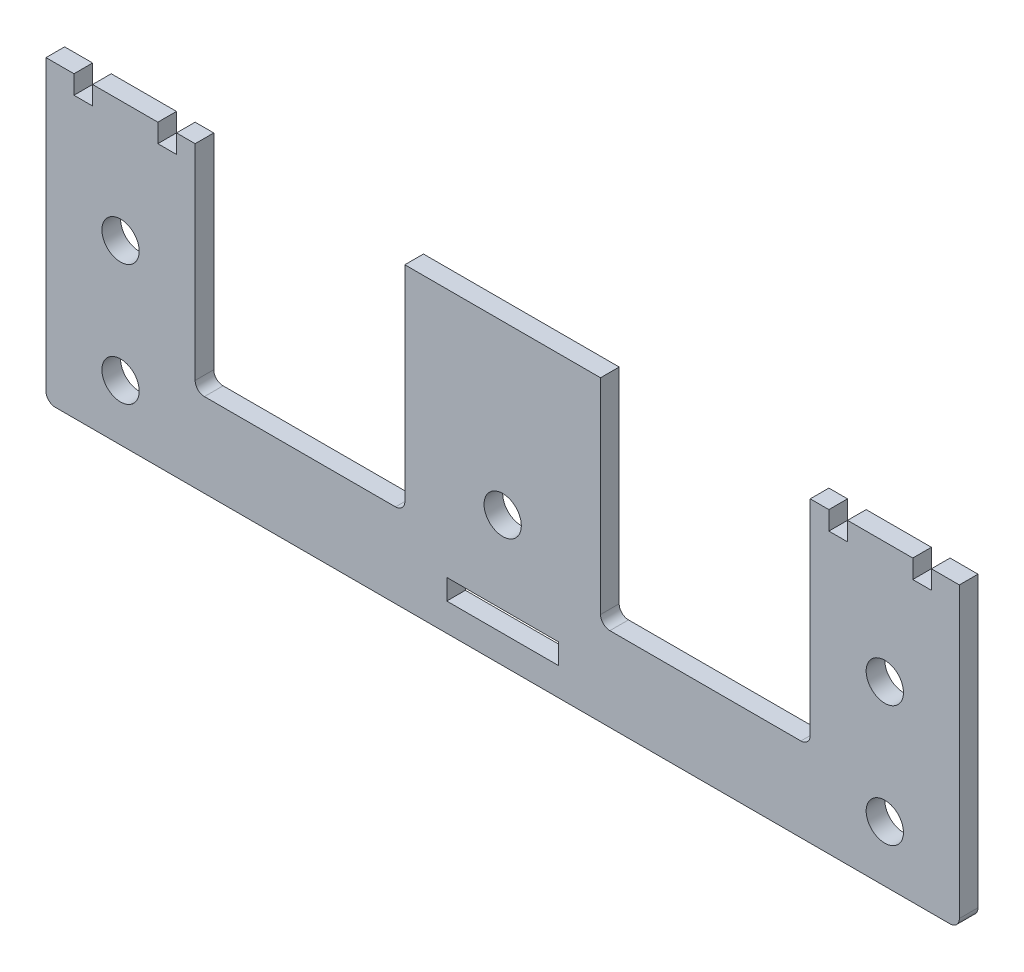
ISO-10303-21;
HEADER;
FILE_DESCRIPTION(('STEP AP214'),'2;1');
FILE_NAME('part.step','',(''),(''),'','','');
FILE_SCHEMA(('AUTOMOTIVE_DESIGN { 1 0 10303 214 1 1 1 1 }'));
ENDSEC;
DATA;
#1=APPLICATION_CONTEXT('core data for automotive mechanical design processes');
#2=APPLICATION_PROTOCOL_DEFINITION('international standard','automotive_design',2000,#1);
#3=PRODUCT_CONTEXT('',#1,'mechanical');
#4=PRODUCT('Part','Part','',(#3));
#5=PRODUCT_RELATED_PRODUCT_CATEGORY('part','',(#4));
#6=PRODUCT_DEFINITION_FORMATION('','',#4);
#7=PRODUCT_DEFINITION_CONTEXT('part definition',#1,'design');
#8=PRODUCT_DEFINITION('design','',#6,#7);
#9=PRODUCT_DEFINITION_SHAPE('','',#8);
#10=(LENGTH_UNIT() NAMED_UNIT(*) SI_UNIT(.MILLI.,.METRE.));
#11=(NAMED_UNIT(*) PLANE_ANGLE_UNIT() SI_UNIT($,.RADIAN.));
#12=(NAMED_UNIT(*) SI_UNIT($,.STERADIAN.) SOLID_ANGLE_UNIT());
#13=UNCERTAINTY_MEASURE_WITH_UNIT(LENGTH_MEASURE(1.E-05),#10,'distance_accuracy_value','');
#14=(GEOMETRIC_REPRESENTATION_CONTEXT(3) GLOBAL_UNCERTAINTY_ASSIGNED_CONTEXT((#13)) GLOBAL_UNIT_ASSIGNED_CONTEXT((#10,
#11,#12)) REPRESENTATION_CONTEXT('',''));
#15=CARTESIAN_POINT('',(0.,0.,0.));
#16=DIRECTION('',(0.,0.,1.));
#17=DIRECTION('',(1.,0.,0.));
#18=AXIS2_PLACEMENT_3D('',#15,#16,#17);
#19=CARTESIAN_POINT('',(24.,0.5,1.));
#20=DIRECTION('',(0.,0.,1.));
#21=DIRECTION('',(1.,0.,0.));
#22=AXIS2_PLACEMENT_3D('',#19,#20,#21);
#23=PLANE('',#22);
#24=CARTESIAN_POINT('',(-20.5,3.,1.));
#25=DIRECTION('',(0.,0.,1.));
#26=DIRECTION('',(1.,0.,0.));
#27=AXIS2_PLACEMENT_3D('',#24,#25,#26);
#28=CIRCLE('',#27,1.);
#29=CARTESIAN_POINT('',(-19.5,3.,1.));
#30=VERTEX_POINT('',#29);
#31=EDGE_CURVE('E309',#30,#30,#28,.T.);
#32=ORIENTED_EDGE('',*,*,#31,.F.);
#33=EDGE_LOOP('',(#32));
#34=FACE_BOUND('',#33,.T.);
#35=CARTESIAN_POINT('',(0.,7.,1.));
#36=DIRECTION('',(0.,0.,1.));
#37=DIRECTION('',(1.,0.,0.));
#38=AXIS2_PLACEMENT_3D('',#35,#36,#37);
#39=CIRCLE('',#38,1.);
#40=CARTESIAN_POINT('',(1.,7.,1.));
#41=VERTEX_POINT('',#40);
#42=EDGE_CURVE('E321',#41,#41,#39,.T.);
#43=ORIENTED_EDGE('',*,*,#42,.F.);
#44=EDGE_LOOP('',(#43));
#45=FACE_BOUND('',#44,.T.);
#46=CARTESIAN_POINT('',(20.5,3.,1.));
#47=DIRECTION('',(0.,0.,1.));
#48=DIRECTION('',(1.,0.,0.));
#49=AXIS2_PLACEMENT_3D('',#46,#47,#48);
#50=CIRCLE('',#49,1.);
#51=CARTESIAN_POINT('',(21.5,3.,1.));
#52=VERTEX_POINT('',#51);
#53=EDGE_CURVE('E333',#52,#52,#50,.T.);
#54=ORIENTED_EDGE('',*,*,#53,.F.);
#55=EDGE_LOOP('',(#54));
#56=FACE_BOUND('',#55,.T.);
#57=DIRECTION('',(-1.,0.,0.));
#58=VECTOR('',#57,1.);
#59=CARTESIAN_POINT('',(23.,16.,1.));
#60=LINE('',#59,#58);
#61=CARTESIAN_POINT('',(24.5,16.,1.));
#62=VERTEX_POINT('',#61);
#63=CARTESIAN_POINT('',(23.,16.,1.));
#64=VERTEX_POINT('',#63);
#65=EDGE_CURVE('E405',#62,#64,#60,.T.);
#66=ORIENTED_EDGE('',*,*,#65,.T.);
#67=DIRECTION('',(0.,-1.,0.));
#68=VECTOR('',#67,1.);
#69=CARTESIAN_POINT('',(23.,16.,1.));
#70=LINE('',#69,#68);
#71=CARTESIAN_POINT('',(23.,15.,1.));
#72=VERTEX_POINT('',#71);
#73=EDGE_CURVE('E408',#64,#72,#70,.T.);
#74=ORIENTED_EDGE('',*,*,#73,.T.);
#75=DIRECTION('',(-1.,0.,0.));
#76=VECTOR('',#75,1.);
#77=CARTESIAN_POINT('',(22.,15.,1.));
#78=LINE('',#77,#76);
#79=CARTESIAN_POINT('',(22.,15.,1.));
#80=VERTEX_POINT('',#79);
#81=EDGE_CURVE('E410',#72,#80,#78,.T.);
#82=ORIENTED_EDGE('',*,*,#81,.T.);
#83=DIRECTION('',(0.,1.,0.));
#84=VECTOR('',#83,1.);
#85=CARTESIAN_POINT('',(22.,16.,1.));
#86=LINE('',#85,#84);
#87=CARTESIAN_POINT('',(22.,16.,1.));
#88=VERTEX_POINT('',#87);
#89=EDGE_CURVE('E412',#80,#88,#86,.T.);
#90=ORIENTED_EDGE('',*,*,#89,.T.);
#91=DIRECTION('',(-1.,0.,0.));
#92=VECTOR('',#91,1.);
#93=CARTESIAN_POINT('',(18.5,16.,1.));
#94=LINE('',#93,#92);
#95=CARTESIAN_POINT('',(18.5,16.,1.));
#96=VERTEX_POINT('',#95);
#97=EDGE_CURVE('E414',#88,#96,#94,.T.);
#98=ORIENTED_EDGE('',*,*,#97,.T.);
#99=DIRECTION('',(0.,-1.,0.));
#100=VECTOR('',#99,1.);
#101=CARTESIAN_POINT('',(18.5,16.,1.));
#102=LINE('',#101,#100);
#103=CARTESIAN_POINT('',(18.5,15.,1.));
#104=VERTEX_POINT('',#103);
#105=EDGE_CURVE('E416',#96,#104,#102,.T.);
#106=ORIENTED_EDGE('',*,*,#105,.T.);
#107=DIRECTION('',(-1.,0.,0.));
#108=VECTOR('',#107,1.);
#109=CARTESIAN_POINT('',(17.5,15.,1.));
#110=LINE('',#109,#108);
#111=CARTESIAN_POINT('',(17.5,15.,1.));
#112=VERTEX_POINT('',#111);
#113=EDGE_CURVE('E418',#104,#112,#110,.T.);
#114=ORIENTED_EDGE('',*,*,#113,.T.);
#115=DIRECTION('',(0.,1.,0.));
#116=VECTOR('',#115,1.);
#117=CARTESIAN_POINT('',(17.5,16.,1.));
#118=LINE('',#117,#116);
#119=CARTESIAN_POINT('',(17.5,16.,1.));
#120=VERTEX_POINT('',#119);
#121=EDGE_CURVE('E420',#112,#120,#118,.T.);
#122=ORIENTED_EDGE('',*,*,#121,.T.);
#123=DIRECTION('',(-1.,0.,0.));
#124=VECTOR('',#123,1.);
#125=CARTESIAN_POINT('',(16.5,16.,1.));
#126=LINE('',#125,#124);
#127=CARTESIAN_POINT('',(16.5,16.,1.));
#128=VERTEX_POINT('',#127);
#129=EDGE_CURVE('E422',#120,#128,#126,.T.);
#130=ORIENTED_EDGE('',*,*,#129,.T.);
#131=DIRECTION('',(0.,-1.,0.));
#132=VECTOR('',#131,1.);
#133=CARTESIAN_POINT('',(16.5,16.,1.));
#134=LINE('',#133,#132);
#135=CARTESIAN_POINT('',(16.5,5.,1.));
#136=VERTEX_POINT('',#135);
#137=EDGE_CURVE('E424',#128,#136,#134,.T.);
#138=ORIENTED_EDGE('',*,*,#137,.T.);
#139=CARTESIAN_POINT('',(16.,5.,1.));
#140=DIRECTION('',(0.,0.,-1.));
#141=DIRECTION('',(1.,0.,0.));
#142=AXIS2_PLACEMENT_3D('',#139,#140,#141);
#143=CIRCLE('',#142,0.500000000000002);
#144=CARTESIAN_POINT('',(16.,4.5,1.));
#145=VERTEX_POINT('',#144);
#146=EDGE_CURVE('E426',#136,#145,#143,.T.);
#147=ORIENTED_EDGE('',*,*,#146,.T.);
#148=DIRECTION('',(-1.,0.,0.));
#149=VECTOR('',#148,1.);
#150=CARTESIAN_POINT('',(5.75,4.5,1.));
#151=LINE('',#150,#149);
#152=CARTESIAN_POINT('',(5.75,4.5,1.));
#153=VERTEX_POINT('',#152);
#154=EDGE_CURVE('E428',#145,#153,#151,.T.);
#155=ORIENTED_EDGE('',*,*,#154,.T.);
#156=CARTESIAN_POINT('',(5.74999999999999,5.,1.));
#157=DIRECTION('',(0.,0.,-1.));
#158=DIRECTION('',(1.,0.,0.));
#159=AXIS2_PLACEMENT_3D('',#156,#157,#158);
#160=CIRCLE('',#159,0.5);
#161=CARTESIAN_POINT('',(5.24999999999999,5.,1.));
#162=VERTEX_POINT('',#161);
#163=EDGE_CURVE('E430',#153,#162,#160,.T.);
#164=ORIENTED_EDGE('',*,*,#163,.T.);
#165=DIRECTION('',(0.,1.,0.));
#166=VECTOR('',#165,1.);
#167=CARTESIAN_POINT('',(5.25,16.,1.));
#168=LINE('',#167,#166);
#169=CARTESIAN_POINT('',(5.25,16.,1.));
#170=VERTEX_POINT('',#169);
#171=EDGE_CURVE('E432',#162,#170,#168,.T.);
#172=ORIENTED_EDGE('',*,*,#171,.T.);
#173=DIRECTION('',(-1.,0.,0.));
#174=VECTOR('',#173,1.);
#175=CARTESIAN_POINT('',(-5.25,16.,1.));
#176=LINE('',#175,#174);
#177=CARTESIAN_POINT('',(-5.25,16.,1.));
#178=VERTEX_POINT('',#177);
#179=EDGE_CURVE('E434',#170,#178,#176,.T.);
#180=ORIENTED_EDGE('',*,*,#179,.T.);
#181=DIRECTION('',(0.,-1.,0.));
#182=VECTOR('',#181,1.);
#183=CARTESIAN_POINT('',(-5.25,16.,1.));
#184=LINE('',#183,#182);
#185=CARTESIAN_POINT('',(-5.24999999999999,5.,1.));
#186=VERTEX_POINT('',#185);
#187=EDGE_CURVE('E436',#178,#186,#184,.T.);
#188=ORIENTED_EDGE('',*,*,#187,.T.);
#189=CARTESIAN_POINT('',(-5.74999999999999,5.,1.));
#190=DIRECTION('',(0.,0.,-1.));
#191=DIRECTION('',(1.,0.,0.));
#192=AXIS2_PLACEMENT_3D('',#189,#190,#191);
#193=CIRCLE('',#192,0.5);
#194=CARTESIAN_POINT('',(-5.75,4.5,1.));
#195=VERTEX_POINT('',#194);
#196=EDGE_CURVE('E438',#186,#195,#193,.T.);
#197=ORIENTED_EDGE('',*,*,#196,.T.);
#198=DIRECTION('',(-1.,0.,0.));
#199=VECTOR('',#198,1.);
#200=CARTESIAN_POINT('',(-16.,4.5,1.));
#201=LINE('',#200,#199);
#202=CARTESIAN_POINT('',(-16.,4.5,1.));
#203=VERTEX_POINT('',#202);
#204=EDGE_CURVE('E440',#195,#203,#201,.T.);
#205=ORIENTED_EDGE('',*,*,#204,.T.);
#206=CARTESIAN_POINT('',(-16.,5.,1.));
#207=DIRECTION('',(0.,0.,-1.));
#208=DIRECTION('',(1.,0.,0.));
#209=AXIS2_PLACEMENT_3D('',#206,#207,#208);
#210=CIRCLE('',#209,0.500000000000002);
#211=CARTESIAN_POINT('',(-16.5,5.,1.));
#212=VERTEX_POINT('',#211);
#213=EDGE_CURVE('E442',#203,#212,#210,.T.);
#214=ORIENTED_EDGE('',*,*,#213,.T.);
#215=DIRECTION('',(0.,1.,0.));
#216=VECTOR('',#215,1.);
#217=CARTESIAN_POINT('',(-16.5,16.,1.));
#218=LINE('',#217,#216);
#219=CARTESIAN_POINT('',(-16.5,16.,1.));
#220=VERTEX_POINT('',#219);
#221=EDGE_CURVE('E444',#212,#220,#218,.T.);
#222=ORIENTED_EDGE('',*,*,#221,.T.);
#223=DIRECTION('',(-1.,0.,0.));
#224=VECTOR('',#223,1.);
#225=CARTESIAN_POINT('',(-17.5,16.,1.));
#226=LINE('',#225,#224);
#227=CARTESIAN_POINT('',(-17.5,16.,1.));
#228=VERTEX_POINT('',#227);
#229=EDGE_CURVE('E446',#220,#228,#226,.T.);
#230=ORIENTED_EDGE('',*,*,#229,.T.);
#231=DIRECTION('',(0.,-1.,0.));
#232=VECTOR('',#231,1.);
#233=CARTESIAN_POINT('',(-17.5,16.,1.));
#234=LINE('',#233,#232);
#235=CARTESIAN_POINT('',(-17.5,15.,1.));
#236=VERTEX_POINT('',#235);
#237=EDGE_CURVE('E448',#228,#236,#234,.T.);
#238=ORIENTED_EDGE('',*,*,#237,.T.);
#239=DIRECTION('',(-1.,0.,0.));
#240=VECTOR('',#239,1.);
#241=CARTESIAN_POINT('',(-17.5,15.,1.));
#242=LINE('',#241,#240);
#243=CARTESIAN_POINT('',(-18.5,15.,1.));
#244=VERTEX_POINT('',#243);
#245=EDGE_CURVE('E450',#236,#244,#242,.T.);
#246=ORIENTED_EDGE('',*,*,#245,.T.);
#247=DIRECTION('',(0.,1.,0.));
#248=VECTOR('',#247,1.);
#249=CARTESIAN_POINT('',(-18.5,16.,1.));
#250=LINE('',#249,#248);
#251=CARTESIAN_POINT('',(-18.5,16.,1.));
#252=VERTEX_POINT('',#251);
#253=EDGE_CURVE('E452',#244,#252,#250,.T.);
#254=ORIENTED_EDGE('',*,*,#253,.T.);
#255=DIRECTION('',(-1.,0.,0.));
#256=VECTOR('',#255,1.);
#257=CARTESIAN_POINT('',(-18.5,16.,1.));
#258=LINE('',#257,#256);
#259=CARTESIAN_POINT('',(-22.,16.,1.));
#260=VERTEX_POINT('',#259);
#261=EDGE_CURVE('E454',#252,#260,#258,.T.);
#262=ORIENTED_EDGE('',*,*,#261,.T.);
#263=DIRECTION('',(0.,-1.,0.));
#264=VECTOR('',#263,1.);
#265=CARTESIAN_POINT('',(-22.,16.,1.));
#266=LINE('',#265,#264);
#267=CARTESIAN_POINT('',(-22.,15.,1.));
#268=VERTEX_POINT('',#267);
#269=EDGE_CURVE('E456',#260,#268,#266,.T.);
#270=ORIENTED_EDGE('',*,*,#269,.T.);
#271=DIRECTION('',(-1.,0.,0.));
#272=VECTOR('',#271,1.);
#273=CARTESIAN_POINT('',(-22.,15.,1.));
#274=LINE('',#273,#272);
#275=CARTESIAN_POINT('',(-23.,15.,1.));
#276=VERTEX_POINT('',#275);
#277=EDGE_CURVE('E458',#268,#276,#274,.T.);
#278=ORIENTED_EDGE('',*,*,#277,.T.);
#279=DIRECTION('',(0.,1.,0.));
#280=VECTOR('',#279,1.);
#281=CARTESIAN_POINT('',(-23.,16.,1.));
#282=LINE('',#281,#280);
#283=CARTESIAN_POINT('',(-23.,16.,1.));
#284=VERTEX_POINT('',#283);
#285=EDGE_CURVE('E460',#276,#284,#282,.T.);
#286=ORIENTED_EDGE('',*,*,#285,.T.);
#287=DIRECTION('',(-1.,0.,0.));
#288=VECTOR('',#287,1.);
#289=CARTESIAN_POINT('',(-24.5,16.,1.));
#290=LINE('',#289,#288);
#291=CARTESIAN_POINT('',(-24.5,16.,1.));
#292=VERTEX_POINT('',#291);
#293=EDGE_CURVE('E462',#284,#292,#290,.T.);
#294=ORIENTED_EDGE('',*,*,#293,.T.);
#295=DIRECTION('',(0.,-1.,0.));
#296=VECTOR('',#295,1.);
#297=CARTESIAN_POINT('',(-24.5,0.5,1.));
#298=LINE('',#297,#296);
#299=CARTESIAN_POINT('',(-24.5,0.5,1.));
#300=VERTEX_POINT('',#299);
#301=EDGE_CURVE('E464',#292,#300,#298,.T.);
#302=ORIENTED_EDGE('',*,*,#301,.T.);
#303=CARTESIAN_POINT('',(-24.,0.5,1.));
#304=DIRECTION('',(0.,0.,1.));
#305=DIRECTION('',(-1.,0.,0.));
#306=AXIS2_PLACEMENT_3D('',#303,#304,#305);
#307=CIRCLE('',#306,0.5);
#308=CARTESIAN_POINT('',(-24.,0.,1.));
#309=VERTEX_POINT('',#308);
#310=EDGE_CURVE('E466',#300,#309,#307,.T.);
#311=ORIENTED_EDGE('',*,*,#310,.T.);
#312=DIRECTION('',(1.,0.,0.));
#313=VECTOR('',#312,1.);
#314=CARTESIAN_POINT('',(-24.,0.,1.));
#315=LINE('',#314,#313);
#316=CARTESIAN_POINT('',(24.,0.,1.));
#317=VERTEX_POINT('',#316);
#318=EDGE_CURVE('E468',#309,#317,#315,.T.);
#319=ORIENTED_EDGE('',*,*,#318,.T.);
#320=CARTESIAN_POINT('',(24.,0.5,1.));
#321=DIRECTION('',(0.,0.,1.));
#322=DIRECTION('',(1.,0.,0.));
#323=AXIS2_PLACEMENT_3D('',#320,#321,#322);
#324=CIRCLE('',#323,0.5);
#325=CARTESIAN_POINT('',(24.5,0.5,1.));
#326=VERTEX_POINT('',#325);
#327=EDGE_CURVE('E470',#317,#326,#324,.T.);
#328=ORIENTED_EDGE('',*,*,#327,.T.);
#329=DIRECTION('',(0.,1.,0.));
#330=VECTOR('',#329,1.);
#331=CARTESIAN_POINT('',(24.5,0.5,1.));
#332=LINE('',#331,#330);
#333=EDGE_CURVE('E472',#326,#62,#332,.T.);
#334=ORIENTED_EDGE('',*,*,#333,.T.);
#335=EDGE_LOOP('',(#66,#74,#82,#90,#98,#106,#114,#122,#130,#138,#147,#155,#164,#172,#180,#188,
#197,#205,#214,#222,#230,#238,#246,#254,#262,#270,#278,#286,#294,#302,#311,#319,#328,#334));
#336=FACE_BOUND('',#335,.T.);
#337=CARTESIAN_POINT('',(20.5,9.5,1.));
#338=DIRECTION('',(0.,0.,1.));
#339=DIRECTION('',(1.,0.,0.));
#340=AXIS2_PLACEMENT_3D('',#337,#338,#339);
#341=CIRCLE('',#340,1.);
#342=CARTESIAN_POINT('',(21.5,9.5,1.));
#343=VERTEX_POINT('',#342);
#344=EDGE_CURVE('E327',#343,#343,#341,.T.);
#345=ORIENTED_EDGE('',*,*,#344,.F.);
#346=EDGE_LOOP('',(#345));
#347=FACE_BOUND('',#346,.T.);
#348=CARTESIAN_POINT('',(-20.5,9.5,1.));
#349=DIRECTION('',(0.,0.,1.));
#350=DIRECTION('',(1.,0.,0.));
#351=AXIS2_PLACEMENT_3D('',#348,#349,#350);
#352=CIRCLE('',#351,1.);
#353=CARTESIAN_POINT('',(-19.5,9.5,1.));
#354=VERTEX_POINT('',#353);
#355=EDGE_CURVE('E315',#354,#354,#352,.T.);
#356=ORIENTED_EDGE('',*,*,#355,.F.);
#357=EDGE_LOOP('',(#356));
#358=FACE_BOUND('',#357,.T.);
#359=DIRECTION('',(1.,0.,0.));
#360=VECTOR('',#359,1.);
#361=CARTESIAN_POINT('',(-3.,1.5,1.));
#362=LINE('',#361,#360);
#363=CARTESIAN_POINT('',(-3.,1.5,1.));
#364=VERTEX_POINT('',#363);
#365=CARTESIAN_POINT('',(3.,1.5,1.));
#366=VERTEX_POINT('',#365);
#367=EDGE_CURVE('E297',#364,#366,#362,.T.);
#368=ORIENTED_EDGE('',*,*,#367,.F.);
#369=DIRECTION('',(0.,-1.,0.));
#370=VECTOR('',#369,1.);
#371=CARTESIAN_POINT('',(-3.,2.6,1.));
#372=LINE('',#371,#370);
#373=CARTESIAN_POINT('',(-3.,2.6,1.));
#374=VERTEX_POINT('',#373);
#375=EDGE_CURVE('E286',#374,#364,#372,.T.);
#376=ORIENTED_EDGE('',*,*,#375,.F.);
#377=DIRECTION('',(-1.,0.,0.));
#378=VECTOR('',#377,1.);
#379=CARTESIAN_POINT('',(-3.,2.6,1.));
#380=LINE('',#379,#378);
#381=CARTESIAN_POINT('',(3.,2.6,1.));
#382=VERTEX_POINT('',#381);
#383=EDGE_CURVE('E301',#382,#374,#380,.T.);
#384=ORIENTED_EDGE('',*,*,#383,.F.);
#385=DIRECTION('',(0.,1.,0.));
#386=VECTOR('',#385,1.);
#387=CARTESIAN_POINT('',(3.,2.6,1.));
#388=LINE('',#387,#386);
#389=EDGE_CURVE('E299',#366,#382,#388,.T.);
#390=ORIENTED_EDGE('',*,*,#389,.F.);
#391=EDGE_LOOP('',(#368,#376,#384,#390));
#392=FACE_BOUND('',#391,.T.);
#393=ADVANCED_FACE('F26',(#34,#45,#56,#336,#347,#358,#392),#23,.T.);
#394=CARTESIAN_POINT('',(24.,0.5,0.));
#395=DIRECTION('',(0.,0.,1.));
#396=DIRECTION('',(1.,0.,0.));
#397=AXIS2_PLACEMENT_3D('',#394,#395,#396);
#398=PLANE('',#397);
#399=CARTESIAN_POINT('',(-20.5,3.,0.));
#400=DIRECTION('',(0.,0.,1.));
#401=DIRECTION('',(1.,0.,0.));
#402=AXIS2_PLACEMENT_3D('',#399,#400,#401);
#403=CIRCLE('',#402,1.);
#404=CARTESIAN_POINT('',(-19.5,3.,0.));
#405=VERTEX_POINT('',#404);
#406=EDGE_CURVE('E287',#405,#405,#403,.T.);
#407=ORIENTED_EDGE('',*,*,#406,.T.);
#408=EDGE_LOOP('',(#407));
#409=FACE_BOUND('',#408,.T.);
#410=CARTESIAN_POINT('',(0.,7.,0.));
#411=DIRECTION('',(0.,0.,1.));
#412=DIRECTION('',(1.,0.,0.));
#413=AXIS2_PLACEMENT_3D('',#410,#411,#412);
#414=CIRCLE('',#413,1.);
#415=CARTESIAN_POINT('',(1.,7.,0.));
#416=VERTEX_POINT('',#415);
#417=EDGE_CURVE('E318',#416,#416,#414,.T.);
#418=ORIENTED_EDGE('',*,*,#417,.T.);
#419=EDGE_LOOP('',(#418));
#420=FACE_BOUND('',#419,.T.);
#421=CARTESIAN_POINT('',(20.5,3.,0.));
#422=DIRECTION('',(0.,0.,1.));
#423=DIRECTION('',(1.,0.,0.));
#424=AXIS2_PLACEMENT_3D('',#421,#422,#423);
#425=CIRCLE('',#424,1.);
#426=CARTESIAN_POINT('',(21.5,3.,0.));
#427=VERTEX_POINT('',#426);
#428=EDGE_CURVE('E330',#427,#427,#425,.T.);
#429=ORIENTED_EDGE('',*,*,#428,.T.);
#430=EDGE_LOOP('',(#429));
#431=FACE_BOUND('',#430,.T.);
#432=DIRECTION('',(-1.,0.,0.));
#433=VECTOR('',#432,1.);
#434=CARTESIAN_POINT('',(23.,16.,0.));
#435=LINE('',#434,#433);
#436=CARTESIAN_POINT('',(24.5,16.,0.));
#437=VERTEX_POINT('',#436);
#438=CARTESIAN_POINT('',(23.,16.,0.));
#439=VERTEX_POINT('',#438);
#440=EDGE_CURVE('E336',#437,#439,#435,.T.);
#441=ORIENTED_EDGE('',*,*,#440,.F.);
#442=DIRECTION('',(0.,1.,0.));
#443=VECTOR('',#442,1.);
#444=CARTESIAN_POINT('',(24.5,0.5,0.));
#445=LINE('',#444,#443);
#446=CARTESIAN_POINT('',(24.5,0.5,0.));
#447=VERTEX_POINT('',#446);
#448=EDGE_CURVE('E403',#447,#437,#445,.T.);
#449=ORIENTED_EDGE('',*,*,#448,.F.);
#450=CARTESIAN_POINT('',(24.,0.5,0.));
#451=DIRECTION('',(0.,0.,1.));
#452=DIRECTION('',(1.,0.,0.));
#453=AXIS2_PLACEMENT_3D('',#450,#451,#452);
#454=CIRCLE('',#453,0.5);
#455=CARTESIAN_POINT('',(24.,0.,0.));
#456=VERTEX_POINT('',#455);
#457=EDGE_CURVE('E401',#456,#447,#454,.T.);
#458=ORIENTED_EDGE('',*,*,#457,.F.);
#459=DIRECTION('',(1.,0.,0.));
#460=VECTOR('',#459,1.);
#461=CARTESIAN_POINT('',(-24.,0.,0.));
#462=LINE('',#461,#460);
#463=CARTESIAN_POINT('',(-24.,0.,0.));
#464=VERTEX_POINT('',#463);
#465=EDGE_CURVE('E399',#464,#456,#462,.T.);
#466=ORIENTED_EDGE('',*,*,#465,.F.);
#467=CARTESIAN_POINT('',(-24.,0.5,0.));
#468=DIRECTION('',(0.,0.,1.));
#469=DIRECTION('',(-1.,0.,0.));
#470=AXIS2_PLACEMENT_3D('',#467,#468,#469);
#471=CIRCLE('',#470,0.5);
#472=CARTESIAN_POINT('',(-24.5,0.5,0.));
#473=VERTEX_POINT('',#472);
#474=EDGE_CURVE('E397',#473,#464,#471,.T.);
#475=ORIENTED_EDGE('',*,*,#474,.F.);
#476=DIRECTION('',(0.,-1.,0.));
#477=VECTOR('',#476,1.);
#478=CARTESIAN_POINT('',(-24.5,0.5,0.));
#479=LINE('',#478,#477);
#480=CARTESIAN_POINT('',(-24.5,16.,0.));
#481=VERTEX_POINT('',#480);
#482=EDGE_CURVE('E395',#481,#473,#479,.T.);
#483=ORIENTED_EDGE('',*,*,#482,.F.);
#484=DIRECTION('',(-1.,0.,0.));
#485=VECTOR('',#484,1.);
#486=CARTESIAN_POINT('',(-24.5,16.,0.));
#487=LINE('',#486,#485);
#488=CARTESIAN_POINT('',(-23.,16.,0.));
#489=VERTEX_POINT('',#488);
#490=EDGE_CURVE('E393',#489,#481,#487,.T.);
#491=ORIENTED_EDGE('',*,*,#490,.F.);
#492=DIRECTION('',(0.,1.,0.));
#493=VECTOR('',#492,1.);
#494=CARTESIAN_POINT('',(-23.,16.,0.));
#495=LINE('',#494,#493);
#496=CARTESIAN_POINT('',(-23.,15.,0.));
#497=VERTEX_POINT('',#496);
#498=EDGE_CURVE('E391',#497,#489,#495,.T.);
#499=ORIENTED_EDGE('',*,*,#498,.F.);
#500=DIRECTION('',(-1.,0.,0.));
#501=VECTOR('',#500,1.);
#502=CARTESIAN_POINT('',(-22.,15.,0.));
#503=LINE('',#502,#501);
#504=CARTESIAN_POINT('',(-22.,15.,0.));
#505=VERTEX_POINT('',#504);
#506=EDGE_CURVE('E389',#505,#497,#503,.T.);
#507=ORIENTED_EDGE('',*,*,#506,.F.);
#508=DIRECTION('',(0.,-1.,0.));
#509=VECTOR('',#508,1.);
#510=CARTESIAN_POINT('',(-22.,16.,0.));
#511=LINE('',#510,#509);
#512=CARTESIAN_POINT('',(-22.,16.,0.));
#513=VERTEX_POINT('',#512);
#514=EDGE_CURVE('E387',#513,#505,#511,.T.);
#515=ORIENTED_EDGE('',*,*,#514,.F.);
#516=DIRECTION('',(-1.,0.,0.));
#517=VECTOR('',#516,1.);
#518=CARTESIAN_POINT('',(-18.5,16.,0.));
#519=LINE('',#518,#517);
#520=CARTESIAN_POINT('',(-18.5,16.,0.));
#521=VERTEX_POINT('',#520);
#522=EDGE_CURVE('E385',#521,#513,#519,.T.);
#523=ORIENTED_EDGE('',*,*,#522,.F.);
#524=DIRECTION('',(0.,1.,0.));
#525=VECTOR('',#524,1.);
#526=CARTESIAN_POINT('',(-18.5,16.,0.));
#527=LINE('',#526,#525);
#528=CARTESIAN_POINT('',(-18.5,15.,0.));
#529=VERTEX_POINT('',#528);
#530=EDGE_CURVE('E383',#529,#521,#527,.T.);
#531=ORIENTED_EDGE('',*,*,#530,.F.);
#532=DIRECTION('',(-1.,0.,0.));
#533=VECTOR('',#532,1.);
#534=CARTESIAN_POINT('',(-17.5,15.,0.));
#535=LINE('',#534,#533);
#536=CARTESIAN_POINT('',(-17.5,15.,0.));
#537=VERTEX_POINT('',#536);
#538=EDGE_CURVE('E381',#537,#529,#535,.T.);
#539=ORIENTED_EDGE('',*,*,#538,.F.);
#540=DIRECTION('',(0.,-1.,0.));
#541=VECTOR('',#540,1.);
#542=CARTESIAN_POINT('',(-17.5,16.,0.));
#543=LINE('',#542,#541);
#544=CARTESIAN_POINT('',(-17.5,16.,0.));
#545=VERTEX_POINT('',#544);
#546=EDGE_CURVE('E379',#545,#537,#543,.T.);
#547=ORIENTED_EDGE('',*,*,#546,.F.);
#548=DIRECTION('',(-1.,0.,0.));
#549=VECTOR('',#548,1.);
#550=CARTESIAN_POINT('',(-17.5,16.,0.));
#551=LINE('',#550,#549);
#552=CARTESIAN_POINT('',(-16.5,16.,0.));
#553=VERTEX_POINT('',#552);
#554=EDGE_CURVE('E377',#553,#545,#551,.T.);
#555=ORIENTED_EDGE('',*,*,#554,.F.);
#556=DIRECTION('',(0.,1.,0.));
#557=VECTOR('',#556,1.);
#558=CARTESIAN_POINT('',(-16.5,16.,0.));
#559=LINE('',#558,#557);
#560=CARTESIAN_POINT('',(-16.5,5.,0.));
#561=VERTEX_POINT('',#560);
#562=EDGE_CURVE('E375',#561,#553,#559,.T.);
#563=ORIENTED_EDGE('',*,*,#562,.F.);
#564=CARTESIAN_POINT('',(-16.,5.,0.));
#565=DIRECTION('',(0.,0.,-1.));
#566=DIRECTION('',(1.,0.,0.));
#567=AXIS2_PLACEMENT_3D('',#564,#565,#566);
#568=CIRCLE('',#567,0.500000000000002);
#569=CARTESIAN_POINT('',(-16.,4.5,0.));
#570=VERTEX_POINT('',#569);
#571=EDGE_CURVE('E373',#570,#561,#568,.T.);
#572=ORIENTED_EDGE('',*,*,#571,.F.);
#573=DIRECTION('',(-1.,0.,0.));
#574=VECTOR('',#573,1.);
#575=CARTESIAN_POINT('',(-16.,4.5,0.));
#576=LINE('',#575,#574);
#577=CARTESIAN_POINT('',(-5.75,4.5,0.));
#578=VERTEX_POINT('',#577);
#579=EDGE_CURVE('E371',#578,#570,#576,.T.);
#580=ORIENTED_EDGE('',*,*,#579,.F.);
#581=CARTESIAN_POINT('',(-5.74999999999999,5.,0.));
#582=DIRECTION('',(0.,0.,-1.));
#583=DIRECTION('',(1.,0.,0.));
#584=AXIS2_PLACEMENT_3D('',#581,#582,#583);
#585=CIRCLE('',#584,0.5);
#586=CARTESIAN_POINT('',(-5.24999999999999,5.,0.));
#587=VERTEX_POINT('',#586);
#588=EDGE_CURVE('E369',#587,#578,#585,.T.);
#589=ORIENTED_EDGE('',*,*,#588,.F.);
#590=DIRECTION('',(0.,-1.,0.));
#591=VECTOR('',#590,1.);
#592=CARTESIAN_POINT('',(-5.25,16.,0.));
#593=LINE('',#592,#591);
#594=CARTESIAN_POINT('',(-5.25,16.,0.));
#595=VERTEX_POINT('',#594);
#596=EDGE_CURVE('E367',#595,#587,#593,.T.);
#597=ORIENTED_EDGE('',*,*,#596,.F.);
#598=DIRECTION('',(-1.,0.,0.));
#599=VECTOR('',#598,1.);
#600=CARTESIAN_POINT('',(-5.25,16.,0.));
#601=LINE('',#600,#599);
#602=CARTESIAN_POINT('',(5.25,16.,0.));
#603=VERTEX_POINT('',#602);
#604=EDGE_CURVE('E365',#603,#595,#601,.T.);
#605=ORIENTED_EDGE('',*,*,#604,.F.);
#606=DIRECTION('',(0.,1.,0.));
#607=VECTOR('',#606,1.);
#608=CARTESIAN_POINT('',(5.25,16.,0.));
#609=LINE('',#608,#607);
#610=CARTESIAN_POINT('',(5.24999999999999,5.,0.));
#611=VERTEX_POINT('',#610);
#612=EDGE_CURVE('E363',#611,#603,#609,.T.);
#613=ORIENTED_EDGE('',*,*,#612,.F.);
#614=CARTESIAN_POINT('',(5.74999999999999,5.,0.));
#615=DIRECTION('',(0.,0.,-1.));
#616=DIRECTION('',(1.,0.,0.));
#617=AXIS2_PLACEMENT_3D('',#614,#615,#616);
#618=CIRCLE('',#617,0.5);
#619=CARTESIAN_POINT('',(5.75,4.5,0.));
#620=VERTEX_POINT('',#619);
#621=EDGE_CURVE('E361',#620,#611,#618,.T.);
#622=ORIENTED_EDGE('',*,*,#621,.F.);
#623=DIRECTION('',(-1.,0.,0.));
#624=VECTOR('',#623,1.);
#625=CARTESIAN_POINT('',(5.75,4.5,0.));
#626=LINE('',#625,#624);
#627=CARTESIAN_POINT('',(16.,4.5,0.));
#628=VERTEX_POINT('',#627);
#629=EDGE_CURVE('E359',#628,#620,#626,.T.);
#630=ORIENTED_EDGE('',*,*,#629,.F.);
#631=CARTESIAN_POINT('',(16.,5.,0.));
#632=DIRECTION('',(0.,0.,-1.));
#633=DIRECTION('',(1.,0.,0.));
#634=AXIS2_PLACEMENT_3D('',#631,#632,#633);
#635=CIRCLE('',#634,0.500000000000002);
#636=CARTESIAN_POINT('',(16.5,5.,0.));
#637=VERTEX_POINT('',#636);
#638=EDGE_CURVE('E357',#637,#628,#635,.T.);
#639=ORIENTED_EDGE('',*,*,#638,.F.);
#640=DIRECTION('',(0.,-1.,0.));
#641=VECTOR('',#640,1.);
#642=CARTESIAN_POINT('',(16.5,16.,0.));
#643=LINE('',#642,#641);
#644=CARTESIAN_POINT('',(16.5,16.,0.));
#645=VERTEX_POINT('',#644);
#646=EDGE_CURVE('E355',#645,#637,#643,.T.);
#647=ORIENTED_EDGE('',*,*,#646,.F.);
#648=DIRECTION('',(-1.,0.,0.));
#649=VECTOR('',#648,1.);
#650=CARTESIAN_POINT('',(16.5,16.,0.));
#651=LINE('',#650,#649);
#652=CARTESIAN_POINT('',(17.5,16.,0.));
#653=VERTEX_POINT('',#652);
#654=EDGE_CURVE('E353',#653,#645,#651,.T.);
#655=ORIENTED_EDGE('',*,*,#654,.F.);
#656=DIRECTION('',(0.,1.,0.));
#657=VECTOR('',#656,1.);
#658=CARTESIAN_POINT('',(17.5,16.,0.));
#659=LINE('',#658,#657);
#660=CARTESIAN_POINT('',(17.5,15.,0.));
#661=VERTEX_POINT('',#660);
#662=EDGE_CURVE('E351',#661,#653,#659,.T.);
#663=ORIENTED_EDGE('',*,*,#662,.F.);
#664=DIRECTION('',(-1.,0.,0.));
#665=VECTOR('',#664,1.);
#666=CARTESIAN_POINT('',(17.5,15.,0.));
#667=LINE('',#666,#665);
#668=CARTESIAN_POINT('',(18.5,15.,0.));
#669=VERTEX_POINT('',#668);
#670=EDGE_CURVE('E349',#669,#661,#667,.T.);
#671=ORIENTED_EDGE('',*,*,#670,.F.);
#672=DIRECTION('',(0.,-1.,0.));
#673=VECTOR('',#672,1.);
#674=CARTESIAN_POINT('',(18.5,16.,0.));
#675=LINE('',#674,#673);
#676=CARTESIAN_POINT('',(18.5,16.,0.));
#677=VERTEX_POINT('',#676);
#678=EDGE_CURVE('E347',#677,#669,#675,.T.);
#679=ORIENTED_EDGE('',*,*,#678,.F.);
#680=DIRECTION('',(-1.,0.,0.));
#681=VECTOR('',#680,1.);
#682=CARTESIAN_POINT('',(18.5,16.,0.));
#683=LINE('',#682,#681);
#684=CARTESIAN_POINT('',(22.,16.,0.));
#685=VERTEX_POINT('',#684);
#686=EDGE_CURVE('E345',#685,#677,#683,.T.);
#687=ORIENTED_EDGE('',*,*,#686,.F.);
#688=DIRECTION('',(0.,1.,0.));
#689=VECTOR('',#688,1.);
#690=CARTESIAN_POINT('',(22.,16.,0.));
#691=LINE('',#690,#689);
#692=CARTESIAN_POINT('',(22.,15.,0.));
#693=VERTEX_POINT('',#692);
#694=EDGE_CURVE('E343',#693,#685,#691,.T.);
#695=ORIENTED_EDGE('',*,*,#694,.F.);
#696=DIRECTION('',(-1.,0.,0.));
#697=VECTOR('',#696,1.);
#698=CARTESIAN_POINT('',(22.,15.,0.));
#699=LINE('',#698,#697);
#700=CARTESIAN_POINT('',(23.,15.,0.));
#701=VERTEX_POINT('',#700);
#702=EDGE_CURVE('E341',#701,#693,#699,.T.);
#703=ORIENTED_EDGE('',*,*,#702,.F.);
#704=DIRECTION('',(0.,-1.,0.));
#705=VECTOR('',#704,1.);
#706=CARTESIAN_POINT('',(23.,16.,0.));
#707=LINE('',#706,#705);
#708=EDGE_CURVE('E339',#439,#701,#707,.T.);
#709=ORIENTED_EDGE('',*,*,#708,.F.);
#710=EDGE_LOOP('',(#441,#449,#458,#466,#475,#483,#491,#499,#507,#515,#523,#531,#539,#547,#555,
#563,#572,#580,#589,#597,#605,#613,#622,#630,#639,#647,#655,#663,#671,#679,#687,#695,#703,#709));
#711=FACE_BOUND('',#710,.T.);
#712=CARTESIAN_POINT('',(20.5,9.5,0.));
#713=DIRECTION('',(0.,0.,1.));
#714=DIRECTION('',(1.,0.,0.));
#715=AXIS2_PLACEMENT_3D('',#712,#713,#714);
#716=CIRCLE('',#715,1.);
#717=CARTESIAN_POINT('',(21.5,9.5,0.));
#718=VERTEX_POINT('',#717);
#719=EDGE_CURVE('E324',#718,#718,#716,.T.);
#720=ORIENTED_EDGE('',*,*,#719,.T.);
#721=EDGE_LOOP('',(#720));
#722=FACE_BOUND('',#721,.T.);
#723=CARTESIAN_POINT('',(-20.5,9.5,0.));
#724=DIRECTION('',(0.,0.,1.));
#725=DIRECTION('',(1.,0.,0.));
#726=AXIS2_PLACEMENT_3D('',#723,#724,#725);
#727=CIRCLE('',#726,1.);
#728=CARTESIAN_POINT('',(-19.5,9.5,0.));
#729=VERTEX_POINT('',#728);
#730=EDGE_CURVE('E312',#729,#729,#727,.T.);
#731=ORIENTED_EDGE('',*,*,#730,.T.);
#732=EDGE_LOOP('',(#731));
#733=FACE_BOUND('',#732,.T.);
#734=DIRECTION('',(0.,-1.,0.));
#735=VECTOR('',#734,1.);
#736=CARTESIAN_POINT('',(-3.,2.6,0.));
#737=LINE('',#736,#735);
#738=CARTESIAN_POINT('',(-3.,2.6,0.));
#739=VERTEX_POINT('',#738);
#740=CARTESIAN_POINT('',(-3.,1.5,0.));
#741=VERTEX_POINT('',#740);
#742=EDGE_CURVE('E49',#739,#741,#737,.T.);
#743=ORIENTED_EDGE('',*,*,#742,.T.);
#744=DIRECTION('',(1.,0.,0.));
#745=VECTOR('',#744,1.);
#746=CARTESIAN_POINT('',(-3.,1.5,0.));
#747=LINE('',#746,#745);
#748=CARTESIAN_POINT('',(3.,1.5,0.));
#749=VERTEX_POINT('',#748);
#750=EDGE_CURVE('E273',#741,#749,#747,.T.);
#751=ORIENTED_EDGE('',*,*,#750,.T.);
#752=DIRECTION('',(0.,1.,0.));
#753=VECTOR('',#752,1.);
#754=CARTESIAN_POINT('',(3.,2.6,0.));
#755=LINE('',#754,#753);
#756=CARTESIAN_POINT('',(3.,2.6,0.));
#757=VERTEX_POINT('',#756);
#758=EDGE_CURVE('E282',#749,#757,#755,.T.);
#759=ORIENTED_EDGE('',*,*,#758,.T.);
#760=DIRECTION('',(-1.,0.,0.));
#761=VECTOR('',#760,1.);
#762=CARTESIAN_POINT('',(-3.,2.6,0.));
#763=LINE('',#762,#761);
#764=EDGE_CURVE('E291',#757,#739,#763,.T.);
#765=ORIENTED_EDGE('',*,*,#764,.T.);
#766=EDGE_LOOP('',(#743,#751,#759,#765));
#767=FACE_BOUND('',#766,.T.);
#768=ADVANCED_FACE('F290',(#409,#420,#431,#711,#722,#733,#767),#398,.F.);
#769=CARTESIAN_POINT('',(23.,16.,1.));
#770=DIRECTION('',(0.,-1.,0.));
#771=DIRECTION('',(0.,0.,-1.));
#772=AXIS2_PLACEMENT_3D('',#769,#770,#771);
#773=PLANE('',#772);
#774=ORIENTED_EDGE('',*,*,#440,.T.);
#775=DIRECTION('',(0.,0.,-1.));
#776=VECTOR('',#775,1.);
#777=CARTESIAN_POINT('',(23.,16.,1.));
#778=LINE('',#777,#776);
#779=EDGE_CURVE('E11',#64,#439,#778,.T.);
#780=ORIENTED_EDGE('',*,*,#779,.F.);
#781=ORIENTED_EDGE('',*,*,#65,.F.);
#782=DIRECTION('',(0.,0.,-1.));
#783=VECTOR('',#782,1.);
#784=CARTESIAN_POINT('',(24.5,16.,1.));
#785=LINE('',#784,#783);
#786=EDGE_CURVE('E474',#62,#437,#785,.T.);
#787=ORIENTED_EDGE('',*,*,#786,.T.);
#788=EDGE_LOOP('',(#774,#780,#781,#787));
#789=FACE_BOUND('',#788,.T.);
#790=ADVANCED_FACE('F28',(#789),#773,.F.);
#791=CARTESIAN_POINT('',(23.,16.,1.));
#792=DIRECTION('',(1.,0.,0.));
#793=DIRECTION('',(0.,0.,-1.));
#794=AXIS2_PLACEMENT_3D('',#791,#792,#793);
#795=PLANE('',#794);
#796=ORIENTED_EDGE('',*,*,#708,.T.);
#797=DIRECTION('',(0.,0.,-1.));
#798=VECTOR('',#797,1.);
#799=CARTESIAN_POINT('',(23.,15.,1.));
#800=LINE('',#799,#798);
#801=EDGE_CURVE('E34',#72,#701,#800,.T.);
#802=ORIENTED_EDGE('',*,*,#801,.F.);
#803=ORIENTED_EDGE('',*,*,#73,.F.);
#804=ORIENTED_EDGE('',*,*,#779,.T.);
#805=EDGE_LOOP('',(#796,#802,#803,#804));
#806=FACE_BOUND('',#805,.T.);
#807=ADVANCED_FACE('F597',(#806),#795,.F.);
#808=CARTESIAN_POINT('',(22.,15.,1.));
#809=DIRECTION('',(0.,-1.,0.));
#810=DIRECTION('',(0.,0.,-1.));
#811=AXIS2_PLACEMENT_3D('',#808,#809,#810);
#812=PLANE('',#811);
#813=ORIENTED_EDGE('',*,*,#702,.T.);
#814=DIRECTION('',(0.,0.,-1.));
#815=VECTOR('',#814,1.);
#816=CARTESIAN_POINT('',(22.,15.,1.));
#817=LINE('',#816,#815);
#818=EDGE_CURVE('E567',#80,#693,#817,.T.);
#819=ORIENTED_EDGE('',*,*,#818,.F.);
#820=ORIENTED_EDGE('',*,*,#81,.F.);
#821=ORIENTED_EDGE('',*,*,#801,.T.);
#822=EDGE_LOOP('',(#813,#819,#820,#821));
#823=FACE_BOUND('',#822,.T.);
#824=ADVANCED_FACE('F574',(#823),#812,.F.);
#825=CARTESIAN_POINT('',(22.,16.,1.));
#826=DIRECTION('',(-1.,0.,0.));
#827=DIRECTION('',(0.,0.,1.));
#828=AXIS2_PLACEMENT_3D('',#825,#826,#827);
#829=PLANE('',#828);
#830=ORIENTED_EDGE('',*,*,#694,.T.);
#831=DIRECTION('',(0.,0.,-1.));
#832=VECTOR('',#831,1.);
#833=CARTESIAN_POINT('',(22.,16.,1.));
#834=LINE('',#833,#832);
#835=EDGE_CURVE('E564',#88,#685,#834,.T.);
#836=ORIENTED_EDGE('',*,*,#835,.F.);
#837=ORIENTED_EDGE('',*,*,#89,.F.);
#838=ORIENTED_EDGE('',*,*,#818,.T.);
#839=EDGE_LOOP('',(#830,#836,#837,#838));
#840=FACE_BOUND('',#839,.T.);
#841=ADVANCED_FACE('F585',(#840),#829,.F.);
#842=CARTESIAN_POINT('',(18.5,16.,1.));
#843=DIRECTION('',(0.,-1.,0.));
#844=DIRECTION('',(0.,0.,-1.));
#845=AXIS2_PLACEMENT_3D('',#842,#843,#844);
#846=PLANE('',#845);
#847=ORIENTED_EDGE('',*,*,#686,.T.);
#848=DIRECTION('',(0.,0.,-1.));
#849=VECTOR('',#848,1.);
#850=CARTESIAN_POINT('',(18.5,16.,1.));
#851=LINE('',#850,#849);
#852=EDGE_CURVE('E561',#96,#677,#851,.T.);
#853=ORIENTED_EDGE('',*,*,#852,.F.);
#854=ORIENTED_EDGE('',*,*,#97,.F.);
#855=ORIENTED_EDGE('',*,*,#835,.T.);
#856=EDGE_LOOP('',(#847,#853,#854,#855));
#857=FACE_BOUND('',#856,.T.);
#858=ADVANCED_FACE('F589',(#857),#846,.F.);
#859=CARTESIAN_POINT('',(18.5,16.,1.));
#860=DIRECTION('',(1.,0.,0.));
#861=DIRECTION('',(0.,0.,-1.));
#862=AXIS2_PLACEMENT_3D('',#859,#860,#861);
#863=PLANE('',#862);
#864=ORIENTED_EDGE('',*,*,#678,.T.);
#865=DIRECTION('',(0.,0.,-1.));
#866=VECTOR('',#865,1.);
#867=CARTESIAN_POINT('',(18.5,15.,1.));
#868=LINE('',#867,#866);
#869=EDGE_CURVE('E558',#104,#669,#868,.T.);
#870=ORIENTED_EDGE('',*,*,#869,.F.);
#871=ORIENTED_EDGE('',*,*,#105,.F.);
#872=ORIENTED_EDGE('',*,*,#852,.T.);
#873=EDGE_LOOP('',(#864,#870,#871,#872));
#874=FACE_BOUND('',#873,.T.);
#875=ADVANCED_FACE('F740',(#874),#863,.F.);
#876=CARTESIAN_POINT('',(17.5,15.,1.));
#877=DIRECTION('',(0.,-1.,0.));
#878=DIRECTION('',(0.,0.,-1.));
#879=AXIS2_PLACEMENT_3D('',#876,#877,#878);
#880=PLANE('',#879);
#881=ORIENTED_EDGE('',*,*,#670,.T.);
#882=DIRECTION('',(0.,0.,-1.));
#883=VECTOR('',#882,1.);
#884=CARTESIAN_POINT('',(17.5,15.,1.));
#885=LINE('',#884,#883);
#886=EDGE_CURVE('E555',#112,#661,#885,.T.);
#887=ORIENTED_EDGE('',*,*,#886,.F.);
#888=ORIENTED_EDGE('',*,*,#113,.F.);
#889=ORIENTED_EDGE('',*,*,#869,.T.);
#890=EDGE_LOOP('',(#881,#887,#888,#889));
#891=FACE_BOUND('',#890,.T.);
#892=ADVANCED_FACE('F737',(#891),#880,.F.);
#893=CARTESIAN_POINT('',(17.5,16.,1.));
#894=DIRECTION('',(-1.,0.,0.));
#895=DIRECTION('',(0.,0.,1.));
#896=AXIS2_PLACEMENT_3D('',#893,#894,#895);
#897=PLANE('',#896);
#898=ORIENTED_EDGE('',*,*,#662,.T.);
#899=DIRECTION('',(0.,0.,-1.));
#900=VECTOR('',#899,1.);
#901=CARTESIAN_POINT('',(17.5,16.,1.));
#902=LINE('',#901,#900);
#903=EDGE_CURVE('E552',#120,#653,#902,.T.);
#904=ORIENTED_EDGE('',*,*,#903,.F.);
#905=ORIENTED_EDGE('',*,*,#121,.F.);
#906=ORIENTED_EDGE('',*,*,#886,.T.);
#907=EDGE_LOOP('',(#898,#904,#905,#906));
#908=FACE_BOUND('',#907,.T.);
#909=ADVANCED_FACE('F733',(#908),#897,.F.);
#910=CARTESIAN_POINT('',(16.5,16.,1.));
#911=DIRECTION('',(0.,-1.,0.));
#912=DIRECTION('',(0.,0.,-1.));
#913=AXIS2_PLACEMENT_3D('',#910,#911,#912);
#914=PLANE('',#913);
#915=ORIENTED_EDGE('',*,*,#654,.T.);
#916=DIRECTION('',(0.,0.,-1.));
#917=VECTOR('',#916,1.);
#918=CARTESIAN_POINT('',(16.5,16.,1.));
#919=LINE('',#918,#917);
#920=EDGE_CURVE('E549',#128,#645,#919,.T.);
#921=ORIENTED_EDGE('',*,*,#920,.F.);
#922=ORIENTED_EDGE('',*,*,#129,.F.);
#923=ORIENTED_EDGE('',*,*,#903,.T.);
#924=EDGE_LOOP('',(#915,#921,#922,#923));
#925=FACE_BOUND('',#924,.T.);
#926=ADVANCED_FACE('F729',(#925),#914,.F.);
#927=CARTESIAN_POINT('',(16.5,16.,1.));
#928=DIRECTION('',(1.,0.,0.));
#929=DIRECTION('',(0.,1.,0.));
#930=AXIS2_PLACEMENT_3D('',#927,#928,#929);
#931=PLANE('',#930);
#932=ORIENTED_EDGE('',*,*,#646,.T.);
#933=DIRECTION('',(0.,0.,-1.));
#934=VECTOR('',#933,1.);
#935=CARTESIAN_POINT('',(16.5,5.,1.));
#936=LINE('',#935,#934);
#937=EDGE_CURVE('E546',#136,#637,#936,.T.);
#938=ORIENTED_EDGE('',*,*,#937,.F.);
#939=ORIENTED_EDGE('',*,*,#137,.F.);
#940=ORIENTED_EDGE('',*,*,#920,.T.);
#941=EDGE_LOOP('',(#932,#938,#939,#940));
#942=FACE_BOUND('',#941,.T.);
#943=ADVANCED_FACE('F724',(#942),#931,.F.);
#944=CARTESIAN_POINT('',(16.,5.,1.));
#945=DIRECTION('',(0.,0.,-1.));
#946=DIRECTION('',(-1.,0.,0.));
#947=AXIS2_PLACEMENT_3D('',#944,#945,#946);
#948=CYLINDRICAL_SURFACE('',#947,0.500000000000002);
#949=ORIENTED_EDGE('',*,*,#638,.T.);
#950=DIRECTION('',(0.,0.,-1.));
#951=VECTOR('',#950,1.);
#952=CARTESIAN_POINT('',(16.,4.5,1.));
#953=LINE('',#952,#951);
#954=EDGE_CURVE('E543',#145,#628,#953,.T.);
#955=ORIENTED_EDGE('',*,*,#954,.F.);
#956=ORIENTED_EDGE('',*,*,#146,.F.);
#957=ORIENTED_EDGE('',*,*,#937,.T.);
#958=EDGE_LOOP('',(#949,#955,#956,#957));
#959=FACE_BOUND('',#958,.T.);
#960=ADVANCED_FACE('F718',(#959),#948,.F.);
#961=CARTESIAN_POINT('',(5.75,4.5,1.));
#962=DIRECTION('',(0.,-1.,0.));
#963=DIRECTION('',(1.,0.,0.));
#964=AXIS2_PLACEMENT_3D('',#961,#962,#963);
#965=PLANE('',#964);
#966=ORIENTED_EDGE('',*,*,#629,.T.);
#967=DIRECTION('',(0.,0.,-1.));
#968=VECTOR('',#967,1.);
#969=CARTESIAN_POINT('',(5.75,4.5,1.));
#970=LINE('',#969,#968);
#971=EDGE_CURVE('E540',#153,#620,#970,.T.);
#972=ORIENTED_EDGE('',*,*,#971,.F.);
#973=ORIENTED_EDGE('',*,*,#154,.F.);
#974=ORIENTED_EDGE('',*,*,#954,.T.);
#975=EDGE_LOOP('',(#966,#972,#973,#974));
#976=FACE_BOUND('',#975,.T.);
#977=ADVANCED_FACE('F714',(#976),#965,.F.);
#978=CARTESIAN_POINT('',(5.74999999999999,5.,1.));
#979=DIRECTION('',(0.,0.,-1.));
#980=DIRECTION('',(-1.,0.,0.));
#981=AXIS2_PLACEMENT_3D('',#978,#979,#980);
#982=CYLINDRICAL_SURFACE('',#981,0.5);
#983=ORIENTED_EDGE('',*,*,#621,.T.);
#984=DIRECTION('',(0.,0.,-1.));
#985=VECTOR('',#984,1.);
#986=CARTESIAN_POINT('',(5.24999999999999,5.,1.));
#987=LINE('',#986,#985);
#988=EDGE_CURVE('E537',#162,#611,#987,.T.);
#989=ORIENTED_EDGE('',*,*,#988,.F.);
#990=ORIENTED_EDGE('',*,*,#163,.F.);
#991=ORIENTED_EDGE('',*,*,#971,.T.);
#992=EDGE_LOOP('',(#983,#989,#990,#991));
#993=FACE_BOUND('',#992,.T.);
#994=ADVANCED_FACE('F709',(#993),#982,.F.);
#995=CARTESIAN_POINT('',(5.25,16.,1.));
#996=DIRECTION('',(-1.,0.,0.));
#997=DIRECTION('',(0.,-1.,0.));
#998=AXIS2_PLACEMENT_3D('',#995,#996,#997);
#999=PLANE('',#998);
#1000=ORIENTED_EDGE('',*,*,#612,.T.);
#1001=DIRECTION('',(0.,0.,-1.));
#1002=VECTOR('',#1001,1.);
#1003=CARTESIAN_POINT('',(5.25,16.,1.));
#1004=LINE('',#1003,#1002);
#1005=EDGE_CURVE('E534',#170,#603,#1004,.T.);
#1006=ORIENTED_EDGE('',*,*,#1005,.F.);
#1007=ORIENTED_EDGE('',*,*,#171,.F.);
#1008=ORIENTED_EDGE('',*,*,#988,.T.);
#1009=EDGE_LOOP('',(#1000,#1006,#1007,#1008));
#1010=FACE_BOUND('',#1009,.T.);
#1011=ADVANCED_FACE('F703',(#1010),#999,.F.);
#1012=CARTESIAN_POINT('',(-5.25,16.,1.));
#1013=DIRECTION('',(0.,-1.,0.));
#1014=DIRECTION('',(0.,0.,-1.));
#1015=AXIS2_PLACEMENT_3D('',#1012,#1013,#1014);
#1016=PLANE('',#1015);
#1017=ORIENTED_EDGE('',*,*,#604,.T.);
#1018=DIRECTION('',(0.,0.,-1.));
#1019=VECTOR('',#1018,1.);
#1020=CARTESIAN_POINT('',(-5.25,16.,1.));
#1021=LINE('',#1020,#1019);
#1022=EDGE_CURVE('E531',#178,#595,#1021,.T.);
#1023=ORIENTED_EDGE('',*,*,#1022,.F.);
#1024=ORIENTED_EDGE('',*,*,#179,.F.);
#1025=ORIENTED_EDGE('',*,*,#1005,.T.);
#1026=EDGE_LOOP('',(#1017,#1023,#1024,#1025));
#1027=FACE_BOUND('',#1026,.T.);
#1028=ADVANCED_FACE('F699',(#1027),#1016,.F.);
#1029=CARTESIAN_POINT('',(-5.25,16.,1.));
#1030=DIRECTION('',(1.,0.,0.));
#1031=DIRECTION('',(0.,1.,0.));
#1032=AXIS2_PLACEMENT_3D('',#1029,#1030,#1031);
#1033=PLANE('',#1032);
#1034=ORIENTED_EDGE('',*,*,#596,.T.);
#1035=DIRECTION('',(0.,0.,-1.));
#1036=VECTOR('',#1035,1.);
#1037=CARTESIAN_POINT('',(-5.24999999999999,5.,1.));
#1038=LINE('',#1037,#1036);
#1039=EDGE_CURVE('E528',#186,#587,#1038,.T.);
#1040=ORIENTED_EDGE('',*,*,#1039,.F.);
#1041=ORIENTED_EDGE('',*,*,#187,.F.);
#1042=ORIENTED_EDGE('',*,*,#1022,.T.);
#1043=EDGE_LOOP('',(#1034,#1040,#1041,#1042));
#1044=FACE_BOUND('',#1043,.T.);
#1045=ADVANCED_FACE('F694',(#1044),#1033,.F.);
#1046=CARTESIAN_POINT('',(-5.74999999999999,5.,1.));
#1047=DIRECTION('',(0.,0.,-1.));
#1048=DIRECTION('',(-1.,0.,0.));
#1049=AXIS2_PLACEMENT_3D('',#1046,#1047,#1048);
#1050=CYLINDRICAL_SURFACE('',#1049,0.5);
#1051=ORIENTED_EDGE('',*,*,#588,.T.);
#1052=DIRECTION('',(0.,0.,-1.));
#1053=VECTOR('',#1052,1.);
#1054=CARTESIAN_POINT('',(-5.75,4.5,1.));
#1055=LINE('',#1054,#1053);
#1056=EDGE_CURVE('E525',#195,#578,#1055,.T.);
#1057=ORIENTED_EDGE('',*,*,#1056,.F.);
#1058=ORIENTED_EDGE('',*,*,#196,.F.);
#1059=ORIENTED_EDGE('',*,*,#1039,.T.);
#1060=EDGE_LOOP('',(#1051,#1057,#1058,#1059));
#1061=FACE_BOUND('',#1060,.T.);
#1062=ADVANCED_FACE('F688',(#1061),#1050,.F.);
#1063=CARTESIAN_POINT('',(-16.,4.5,1.));
#1064=DIRECTION('',(0.,-1.,0.));
#1065=DIRECTION('',(1.,0.,0.));
#1066=AXIS2_PLACEMENT_3D('',#1063,#1064,#1065);
#1067=PLANE('',#1066);
#1068=ORIENTED_EDGE('',*,*,#579,.T.);
#1069=DIRECTION('',(0.,0.,-1.));
#1070=VECTOR('',#1069,1.);
#1071=CARTESIAN_POINT('',(-16.,4.5,1.));
#1072=LINE('',#1071,#1070);
#1073=EDGE_CURVE('E522',#203,#570,#1072,.T.);
#1074=ORIENTED_EDGE('',*,*,#1073,.F.);
#1075=ORIENTED_EDGE('',*,*,#204,.F.);
#1076=ORIENTED_EDGE('',*,*,#1056,.T.);
#1077=EDGE_LOOP('',(#1068,#1074,#1075,#1076));
#1078=FACE_BOUND('',#1077,.T.);
#1079=ADVANCED_FACE('F684',(#1078),#1067,.F.);
#1080=CARTESIAN_POINT('',(-16.,5.,1.));
#1081=DIRECTION('',(0.,0.,-1.));
#1082=DIRECTION('',(-1.,0.,0.));
#1083=AXIS2_PLACEMENT_3D('',#1080,#1081,#1082);
#1084=CYLINDRICAL_SURFACE('',#1083,0.500000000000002);
#1085=ORIENTED_EDGE('',*,*,#571,.T.);
#1086=DIRECTION('',(0.,0.,-1.));
#1087=VECTOR('',#1086,1.);
#1088=CARTESIAN_POINT('',(-16.5,5.,1.));
#1089=LINE('',#1088,#1087);
#1090=EDGE_CURVE('E519',#212,#561,#1089,.T.);
#1091=ORIENTED_EDGE('',*,*,#1090,.F.);
#1092=ORIENTED_EDGE('',*,*,#213,.F.);
#1093=ORIENTED_EDGE('',*,*,#1073,.T.);
#1094=EDGE_LOOP('',(#1085,#1091,#1092,#1093));
#1095=FACE_BOUND('',#1094,.T.);
#1096=ADVANCED_FACE('F679',(#1095),#1084,.F.);
#1097=CARTESIAN_POINT('',(-16.5,16.,1.));
#1098=DIRECTION('',(-1.,0.,0.));
#1099=DIRECTION('',(0.,-1.,0.));
#1100=AXIS2_PLACEMENT_3D('',#1097,#1098,#1099);
#1101=PLANE('',#1100);
#1102=ORIENTED_EDGE('',*,*,#562,.T.);
#1103=DIRECTION('',(0.,0.,-1.));
#1104=VECTOR('',#1103,1.);
#1105=CARTESIAN_POINT('',(-16.5,16.,1.));
#1106=LINE('',#1105,#1104);
#1107=EDGE_CURVE('E516',#220,#553,#1106,.T.);
#1108=ORIENTED_EDGE('',*,*,#1107,.F.);
#1109=ORIENTED_EDGE('',*,*,#221,.F.);
#1110=ORIENTED_EDGE('',*,*,#1090,.T.);
#1111=EDGE_LOOP('',(#1102,#1108,#1109,#1110));
#1112=FACE_BOUND('',#1111,.T.);
#1113=ADVANCED_FACE('F673',(#1112),#1101,.F.);
#1114=CARTESIAN_POINT('',(-17.5,16.,1.));
#1115=DIRECTION('',(0.,-1.,0.));
#1116=DIRECTION('',(0.,0.,-1.));
#1117=AXIS2_PLACEMENT_3D('',#1114,#1115,#1116);
#1118=PLANE('',#1117);
#1119=ORIENTED_EDGE('',*,*,#554,.T.);
#1120=DIRECTION('',(0.,0.,-1.));
#1121=VECTOR('',#1120,1.);
#1122=CARTESIAN_POINT('',(-17.5,16.,1.));
#1123=LINE('',#1122,#1121);
#1124=EDGE_CURVE('E513',#228,#545,#1123,.T.);
#1125=ORIENTED_EDGE('',*,*,#1124,.F.);
#1126=ORIENTED_EDGE('',*,*,#229,.F.);
#1127=ORIENTED_EDGE('',*,*,#1107,.T.);
#1128=EDGE_LOOP('',(#1119,#1125,#1126,#1127));
#1129=FACE_BOUND('',#1128,.T.);
#1130=ADVANCED_FACE('F669',(#1129),#1118,.F.);
#1131=CARTESIAN_POINT('',(-17.5,16.,1.));
#1132=DIRECTION('',(1.,0.,0.));
#1133=DIRECTION('',(0.,0.,-1.));
#1134=AXIS2_PLACEMENT_3D('',#1131,#1132,#1133);
#1135=PLANE('',#1134);
#1136=ORIENTED_EDGE('',*,*,#546,.T.);
#1137=DIRECTION('',(0.,0.,-1.));
#1138=VECTOR('',#1137,1.);
#1139=CARTESIAN_POINT('',(-17.5,15.,1.));
#1140=LINE('',#1139,#1138);
#1141=EDGE_CURVE('E510',#236,#537,#1140,.T.);
#1142=ORIENTED_EDGE('',*,*,#1141,.F.);
#1143=ORIENTED_EDGE('',*,*,#237,.F.);
#1144=ORIENTED_EDGE('',*,*,#1124,.T.);
#1145=EDGE_LOOP('',(#1136,#1142,#1143,#1144));
#1146=FACE_BOUND('',#1145,.T.);
#1147=ADVANCED_FACE('F664',(#1146),#1135,.F.);
#1148=CARTESIAN_POINT('',(-17.5,15.,1.));
#1149=DIRECTION('',(0.,-1.,0.));
#1150=DIRECTION('',(0.,0.,-1.));
#1151=AXIS2_PLACEMENT_3D('',#1148,#1149,#1150);
#1152=PLANE('',#1151);
#1153=ORIENTED_EDGE('',*,*,#538,.T.);
#1154=DIRECTION('',(0.,0.,-1.));
#1155=VECTOR('',#1154,1.);
#1156=CARTESIAN_POINT('',(-18.5,15.,1.));
#1157=LINE('',#1156,#1155);
#1158=EDGE_CURVE('E507',#244,#529,#1157,.T.);
#1159=ORIENTED_EDGE('',*,*,#1158,.F.);
#1160=ORIENTED_EDGE('',*,*,#245,.F.);
#1161=ORIENTED_EDGE('',*,*,#1141,.T.);
#1162=EDGE_LOOP('',(#1153,#1159,#1160,#1161));
#1163=FACE_BOUND('',#1162,.T.);
#1164=ADVANCED_FACE('F658',(#1163),#1152,.F.);
#1165=CARTESIAN_POINT('',(-18.5,16.,1.));
#1166=DIRECTION('',(-1.,0.,0.));
#1167=DIRECTION('',(0.,0.,1.));
#1168=AXIS2_PLACEMENT_3D('',#1165,#1166,#1167);
#1169=PLANE('',#1168);
#1170=ORIENTED_EDGE('',*,*,#530,.T.);
#1171=DIRECTION('',(0.,0.,-1.));
#1172=VECTOR('',#1171,1.);
#1173=CARTESIAN_POINT('',(-18.5,16.,1.));
#1174=LINE('',#1173,#1172);
#1175=EDGE_CURVE('E504',#252,#521,#1174,.T.);
#1176=ORIENTED_EDGE('',*,*,#1175,.F.);
#1177=ORIENTED_EDGE('',*,*,#253,.F.);
#1178=ORIENTED_EDGE('',*,*,#1158,.T.);
#1179=EDGE_LOOP('',(#1170,#1176,#1177,#1178));
#1180=FACE_BOUND('',#1179,.T.);
#1181=ADVANCED_FACE('F654',(#1180),#1169,.F.);
#1182=CARTESIAN_POINT('',(-18.5,16.,1.));
#1183=DIRECTION('',(0.,-1.,0.));
#1184=DIRECTION('',(0.,0.,-1.));
#1185=AXIS2_PLACEMENT_3D('',#1182,#1183,#1184);
#1186=PLANE('',#1185);
#1187=ORIENTED_EDGE('',*,*,#522,.T.);
#1188=DIRECTION('',(0.,0.,-1.));
#1189=VECTOR('',#1188,1.);
#1190=CARTESIAN_POINT('',(-22.,16.,1.));
#1191=LINE('',#1190,#1189);
#1192=EDGE_CURVE('E501',#260,#513,#1191,.T.);
#1193=ORIENTED_EDGE('',*,*,#1192,.F.);
#1194=ORIENTED_EDGE('',*,*,#261,.F.);
#1195=ORIENTED_EDGE('',*,*,#1175,.T.);
#1196=EDGE_LOOP('',(#1187,#1193,#1194,#1195));
#1197=FACE_BOUND('',#1196,.T.);
#1198=ADVANCED_FACE('F649',(#1197),#1186,.F.);
#1199=CARTESIAN_POINT('',(-22.,16.,1.));
#1200=DIRECTION('',(1.,0.,0.));
#1201=DIRECTION('',(0.,0.,-1.));
#1202=AXIS2_PLACEMENT_3D('',#1199,#1200,#1201);
#1203=PLANE('',#1202);
#1204=ORIENTED_EDGE('',*,*,#514,.T.);
#1205=DIRECTION('',(0.,0.,-1.));
#1206=VECTOR('',#1205,1.);
#1207=CARTESIAN_POINT('',(-22.,15.,1.));
#1208=LINE('',#1207,#1206);
#1209=EDGE_CURVE('E498',#268,#505,#1208,.T.);
#1210=ORIENTED_EDGE('',*,*,#1209,.F.);
#1211=ORIENTED_EDGE('',*,*,#269,.F.);
#1212=ORIENTED_EDGE('',*,*,#1192,.T.);
#1213=EDGE_LOOP('',(#1204,#1210,#1211,#1212));
#1214=FACE_BOUND('',#1213,.T.);
#1215=ADVANCED_FACE('F643',(#1214),#1203,.F.);
#1216=CARTESIAN_POINT('',(-22.,15.,1.));
#1217=DIRECTION('',(0.,-1.,0.));
#1218=DIRECTION('',(0.,0.,-1.));
#1219=AXIS2_PLACEMENT_3D('',#1216,#1217,#1218);
#1220=PLANE('',#1219);
#1221=ORIENTED_EDGE('',*,*,#506,.T.);
#1222=DIRECTION('',(0.,0.,-1.));
#1223=VECTOR('',#1222,1.);
#1224=CARTESIAN_POINT('',(-23.,15.,1.));
#1225=LINE('',#1224,#1223);
#1226=EDGE_CURVE('E495',#276,#497,#1225,.T.);
#1227=ORIENTED_EDGE('',*,*,#1226,.F.);
#1228=ORIENTED_EDGE('',*,*,#277,.F.);
#1229=ORIENTED_EDGE('',*,*,#1209,.T.);
#1230=EDGE_LOOP('',(#1221,#1227,#1228,#1229));
#1231=FACE_BOUND('',#1230,.T.);
#1232=ADVANCED_FACE('F639',(#1231),#1220,.F.);
#1233=CARTESIAN_POINT('',(-23.,16.,1.));
#1234=DIRECTION('',(-1.,0.,0.));
#1235=DIRECTION('',(0.,0.,1.));
#1236=AXIS2_PLACEMENT_3D('',#1233,#1234,#1235);
#1237=PLANE('',#1236);
#1238=ORIENTED_EDGE('',*,*,#498,.T.);
#1239=DIRECTION('',(0.,0.,-1.));
#1240=VECTOR('',#1239,1.);
#1241=CARTESIAN_POINT('',(-23.,16.,1.));
#1242=LINE('',#1241,#1240);
#1243=EDGE_CURVE('E492',#284,#489,#1242,.T.);
#1244=ORIENTED_EDGE('',*,*,#1243,.F.);
#1245=ORIENTED_EDGE('',*,*,#285,.F.);
#1246=ORIENTED_EDGE('',*,*,#1226,.T.);
#1247=EDGE_LOOP('',(#1238,#1244,#1245,#1246));
#1248=FACE_BOUND('',#1247,.T.);
#1249=ADVANCED_FACE('F634',(#1248),#1237,.F.);
#1250=CARTESIAN_POINT('',(-24.5,16.,1.));
#1251=DIRECTION('',(0.,-1.,0.));
#1252=DIRECTION('',(0.,0.,-1.));
#1253=AXIS2_PLACEMENT_3D('',#1250,#1251,#1252);
#1254=PLANE('',#1253);
#1255=ORIENTED_EDGE('',*,*,#490,.T.);
#1256=DIRECTION('',(0.,0.,-1.));
#1257=VECTOR('',#1256,1.);
#1258=CARTESIAN_POINT('',(-24.5,16.,1.));
#1259=LINE('',#1258,#1257);
#1260=EDGE_CURVE('E489',#292,#481,#1259,.T.);
#1261=ORIENTED_EDGE('',*,*,#1260,.F.);
#1262=ORIENTED_EDGE('',*,*,#293,.F.);
#1263=ORIENTED_EDGE('',*,*,#1243,.T.);
#1264=EDGE_LOOP('',(#1255,#1261,#1262,#1263));
#1265=FACE_BOUND('',#1264,.T.);
#1266=ADVANCED_FACE('F628',(#1265),#1254,.F.);
#1267=CARTESIAN_POINT('',(-24.5,0.5,1.));
#1268=DIRECTION('',(1.,0.,0.));
#1269=DIRECTION('',(0.,1.,0.));
#1270=AXIS2_PLACEMENT_3D('',#1267,#1268,#1269);
#1271=PLANE('',#1270);
#1272=ORIENTED_EDGE('',*,*,#482,.T.);
#1273=DIRECTION('',(0.,0.,-1.));
#1274=VECTOR('',#1273,1.);
#1275=CARTESIAN_POINT('',(-24.5,0.5,1.));
#1276=LINE('',#1275,#1274);
#1277=EDGE_CURVE('E486',#300,#473,#1276,.T.);
#1278=ORIENTED_EDGE('',*,*,#1277,.F.);
#1279=ORIENTED_EDGE('',*,*,#301,.F.);
#1280=ORIENTED_EDGE('',*,*,#1260,.T.);
#1281=EDGE_LOOP('',(#1272,#1278,#1279,#1280));
#1282=FACE_BOUND('',#1281,.T.);
#1283=ADVANCED_FACE('F624',(#1282),#1271,.F.);
#1284=CARTESIAN_POINT('',(-24.,0.5,1.));
#1285=DIRECTION('',(0.,0.,-1.));
#1286=DIRECTION('',(-1.,0.,0.));
#1287=AXIS2_PLACEMENT_3D('',#1284,#1285,#1286);
#1288=CYLINDRICAL_SURFACE('',#1287,0.5);
#1289=ORIENTED_EDGE('',*,*,#474,.T.);
#1290=DIRECTION('',(0.,0.,-1.));
#1291=VECTOR('',#1290,1.);
#1292=CARTESIAN_POINT('',(-24.,0.,1.));
#1293=LINE('',#1292,#1291);
#1294=EDGE_CURVE('E483',#309,#464,#1293,.T.);
#1295=ORIENTED_EDGE('',*,*,#1294,.F.);
#1296=ORIENTED_EDGE('',*,*,#310,.F.);
#1297=ORIENTED_EDGE('',*,*,#1277,.T.);
#1298=EDGE_LOOP('',(#1289,#1295,#1296,#1297));
#1299=FACE_BOUND('',#1298,.T.);
#1300=ADVANCED_FACE('F619',(#1299),#1288,.T.);
#1301=CARTESIAN_POINT('',(-24.,0.,1.));
#1302=DIRECTION('',(0.,1.,0.));
#1303=DIRECTION('',(-1.,0.,0.));
#1304=AXIS2_PLACEMENT_3D('',#1301,#1302,#1303);
#1305=PLANE('',#1304);
#1306=ORIENTED_EDGE('',*,*,#465,.T.);
#1307=DIRECTION('',(0.,0.,-1.));
#1308=VECTOR('',#1307,1.);
#1309=CARTESIAN_POINT('',(24.,0.,1.));
#1310=LINE('',#1309,#1308);
#1311=EDGE_CURVE('E480',#317,#456,#1310,.T.);
#1312=ORIENTED_EDGE('',*,*,#1311,.F.);
#1313=ORIENTED_EDGE('',*,*,#318,.F.);
#1314=ORIENTED_EDGE('',*,*,#1294,.T.);
#1315=EDGE_LOOP('',(#1306,#1312,#1313,#1314));
#1316=FACE_BOUND('',#1315,.T.);
#1317=ADVANCED_FACE('F613',(#1316),#1305,.F.);
#1318=CARTESIAN_POINT('',(24.,0.5,1.));
#1319=DIRECTION('',(0.,0.,-1.));
#1320=DIRECTION('',(-1.,0.,0.));
#1321=AXIS2_PLACEMENT_3D('',#1318,#1319,#1320);
#1322=CYLINDRICAL_SURFACE('',#1321,0.5);
#1323=ORIENTED_EDGE('',*,*,#457,.T.);
#1324=DIRECTION('',(0.,0.,-1.));
#1325=VECTOR('',#1324,1.);
#1326=CARTESIAN_POINT('',(24.5,0.5,1.));
#1327=LINE('',#1326,#1325);
#1328=EDGE_CURVE('E477',#326,#447,#1327,.T.);
#1329=ORIENTED_EDGE('',*,*,#1328,.F.);
#1330=ORIENTED_EDGE('',*,*,#327,.F.);
#1331=ORIENTED_EDGE('',*,*,#1311,.T.);
#1332=EDGE_LOOP('',(#1323,#1329,#1330,#1331));
#1333=FACE_BOUND('',#1332,.T.);
#1334=ADVANCED_FACE('F609',(#1333),#1322,.T.);
#1335=CARTESIAN_POINT('',(24.5,0.5,1.));
#1336=DIRECTION('',(-1.,0.,0.));
#1337=DIRECTION('',(0.,-1.,0.));
#1338=AXIS2_PLACEMENT_3D('',#1335,#1336,#1337);
#1339=PLANE('',#1338);
#1340=ORIENTED_EDGE('',*,*,#448,.T.);
#1341=ORIENTED_EDGE('',*,*,#786,.F.);
#1342=ORIENTED_EDGE('',*,*,#333,.F.);
#1343=ORIENTED_EDGE('',*,*,#1328,.T.);
#1344=EDGE_LOOP('',(#1340,#1341,#1342,#1343));
#1345=FACE_BOUND('',#1344,.T.);
#1346=ADVANCED_FACE('F604',(#1345),#1339,.F.);
#1347=CARTESIAN_POINT('',(20.5,3.,1.));
#1348=DIRECTION('',(0.,0.,-1.));
#1349=DIRECTION('',(-1.,0.,0.));
#1350=AXIS2_PLACEMENT_3D('',#1347,#1348,#1349);
#1351=CYLINDRICAL_SURFACE('',#1350,1.);
#1352=ORIENTED_EDGE('',*,*,#53,.T.);
#1353=EDGE_LOOP('',(#1352));
#1354=FACE_BOUND('',#1353,.T.);
#1355=ORIENTED_EDGE('',*,*,#428,.F.);
#1356=EDGE_LOOP('',(#1355));
#1357=FACE_BOUND('',#1356,.T.);
#1358=ADVANCED_FACE('F763',(#1354,#1357),#1351,.F.);
#1359=CARTESIAN_POINT('',(20.5,9.5,1.));
#1360=DIRECTION('',(0.,0.,-1.));
#1361=DIRECTION('',(-1.,0.,0.));
#1362=AXIS2_PLACEMENT_3D('',#1359,#1360,#1361);
#1363=CYLINDRICAL_SURFACE('',#1362,1.);
#1364=ORIENTED_EDGE('',*,*,#344,.T.);
#1365=EDGE_LOOP('',(#1364));
#1366=FACE_BOUND('',#1365,.T.);
#1367=ORIENTED_EDGE('',*,*,#719,.F.);
#1368=EDGE_LOOP('',(#1367));
#1369=FACE_BOUND('',#1368,.T.);
#1370=ADVANCED_FACE('F929',(#1366,#1369),#1363,.F.);
#1371=CARTESIAN_POINT('',(0.,7.,1.));
#1372=DIRECTION('',(0.,0.,-1.));
#1373=DIRECTION('',(-1.,0.,0.));
#1374=AXIS2_PLACEMENT_3D('',#1371,#1372,#1373);
#1375=CYLINDRICAL_SURFACE('',#1374,1.);
#1376=ORIENTED_EDGE('',*,*,#42,.T.);
#1377=EDGE_LOOP('',(#1376));
#1378=FACE_BOUND('',#1377,.T.);
#1379=ORIENTED_EDGE('',*,*,#417,.F.);
#1380=EDGE_LOOP('',(#1379));
#1381=FACE_BOUND('',#1380,.T.);
#1382=ADVANCED_FACE('F936',(#1378,#1381),#1375,.F.);
#1383=CARTESIAN_POINT('',(-20.5,9.5,1.));
#1384=DIRECTION('',(0.,0.,-1.));
#1385=DIRECTION('',(-1.,0.,0.));
#1386=AXIS2_PLACEMENT_3D('',#1383,#1384,#1385);
#1387=CYLINDRICAL_SURFACE('',#1386,1.);
#1388=ORIENTED_EDGE('',*,*,#355,.T.);
#1389=EDGE_LOOP('',(#1388));
#1390=FACE_BOUND('',#1389,.T.);
#1391=ORIENTED_EDGE('',*,*,#730,.F.);
#1392=EDGE_LOOP('',(#1391));
#1393=FACE_BOUND('',#1392,.T.);
#1394=ADVANCED_FACE('F944',(#1390,#1393),#1387,.F.);
#1395=CARTESIAN_POINT('',(-20.5,3.,1.));
#1396=DIRECTION('',(0.,0.,-1.));
#1397=DIRECTION('',(-1.,0.,0.));
#1398=AXIS2_PLACEMENT_3D('',#1395,#1396,#1397);
#1399=CYLINDRICAL_SURFACE('',#1398,1.);
#1400=ORIENTED_EDGE('',*,*,#31,.T.);
#1401=EDGE_LOOP('',(#1400));
#1402=FACE_BOUND('',#1401,.T.);
#1403=ORIENTED_EDGE('',*,*,#406,.F.);
#1404=EDGE_LOOP('',(#1403));
#1405=FACE_BOUND('',#1404,.T.);
#1406=ADVANCED_FACE('F952',(#1402,#1405),#1399,.F.);
#1407=CARTESIAN_POINT('',(-3.,2.6,1.));
#1408=DIRECTION('',(1.,0.,0.));
#1409=DIRECTION('',(0.,0.,-1.));
#1410=AXIS2_PLACEMENT_3D('',#1407,#1408,#1409);
#1411=PLANE('',#1410);
#1412=ORIENTED_EDGE('',*,*,#742,.F.);
#1413=DIRECTION('',(0.,0.,-1.));
#1414=VECTOR('',#1413,1.);
#1415=CARTESIAN_POINT('',(-3.,2.6,1.));
#1416=LINE('',#1415,#1414);
#1417=EDGE_CURVE('E303',#374,#739,#1416,.T.);
#1418=ORIENTED_EDGE('',*,*,#1417,.F.);
#1419=ORIENTED_EDGE('',*,*,#375,.T.);
#1420=DIRECTION('',(0.,0.,-1.));
#1421=VECTOR('',#1420,1.);
#1422=CARTESIAN_POINT('',(-3.,1.5,1.));
#1423=LINE('',#1422,#1421);
#1424=EDGE_CURVE('E275',#364,#741,#1423,.T.);
#1425=ORIENTED_EDGE('',*,*,#1424,.T.);
#1426=EDGE_LOOP('',(#1412,#1418,#1419,#1425));
#1427=FACE_BOUND('',#1426,.T.);
#1428=ADVANCED_FACE('F284',(#1427),#1411,.T.);
#1429=CARTESIAN_POINT('',(-3.,1.5,1.));
#1430=DIRECTION('',(0.,1.,0.));
#1431=DIRECTION('',(0.,0.,1.));
#1432=AXIS2_PLACEMENT_3D('',#1429,#1430,#1431);
#1433=PLANE('',#1432);
#1434=ORIENTED_EDGE('',*,*,#750,.F.);
#1435=ORIENTED_EDGE('',*,*,#1424,.F.);
#1436=ORIENTED_EDGE('',*,*,#367,.T.);
#1437=DIRECTION('',(0.,0.,-1.));
#1438=VECTOR('',#1437,1.);
#1439=CARTESIAN_POINT('',(3.,1.5,1.));
#1440=LINE('',#1439,#1438);
#1441=EDGE_CURVE('E278',#366,#749,#1440,.T.);
#1442=ORIENTED_EDGE('',*,*,#1441,.T.);
#1443=EDGE_LOOP('',(#1434,#1435,#1436,#1442));
#1444=FACE_BOUND('',#1443,.T.);
#1445=ADVANCED_FACE('F274',(#1444),#1433,.T.);
#1446=CARTESIAN_POINT('',(3.,2.6,1.));
#1447=DIRECTION('',(-1.,0.,0.));
#1448=DIRECTION('',(0.,0.,1.));
#1449=AXIS2_PLACEMENT_3D('',#1446,#1447,#1448);
#1450=PLANE('',#1449);
#1451=ORIENTED_EDGE('',*,*,#758,.F.);
#1452=ORIENTED_EDGE('',*,*,#1441,.F.);
#1453=ORIENTED_EDGE('',*,*,#389,.T.);
#1454=DIRECTION('',(0.,0.,-1.));
#1455=VECTOR('',#1454,1.);
#1456=CARTESIAN_POINT('',(3.,2.6,1.));
#1457=LINE('',#1456,#1455);
#1458=EDGE_CURVE('E41',#382,#757,#1457,.T.);
#1459=ORIENTED_EDGE('',*,*,#1458,.T.);
#1460=EDGE_LOOP('',(#1451,#1452,#1453,#1459));
#1461=FACE_BOUND('',#1460,.T.);
#1462=ADVANCED_FACE('F973',(#1461),#1450,.T.);
#1463=CARTESIAN_POINT('',(-3.,2.6,1.));
#1464=DIRECTION('',(0.,-1.,0.));
#1465=DIRECTION('',(0.,0.,-1.));
#1466=AXIS2_PLACEMENT_3D('',#1463,#1464,#1465);
#1467=PLANE('',#1466);
#1468=ORIENTED_EDGE('',*,*,#764,.F.);
#1469=ORIENTED_EDGE('',*,*,#1458,.F.);
#1470=ORIENTED_EDGE('',*,*,#383,.T.);
#1471=ORIENTED_EDGE('',*,*,#1417,.T.);
#1472=EDGE_LOOP('',(#1468,#1469,#1470,#1471));
#1473=FACE_BOUND('',#1472,.T.);
#1474=ADVANCED_FACE('F980',(#1473),#1467,.T.);
#1475=CLOSED_SHELL('',(#393,#768,#790,#807,#824,#841,#858,#875,#892,#909,#926,#943,#960,#977,
#994,#1011,#1028,#1045,#1062,#1079,#1096,#1113,#1130,#1147,#1164,#1181,#1198,#1215,#1232,#1249,
#1266,#1283,#1300,#1317,#1334,#1346,#1358,#1370,#1382,#1394,#1406,#1428,#1445,#1462,#1474));
#1476=MANIFOLD_SOLID_BREP('B2',#1475);
#1477=ADVANCED_BREP_SHAPE_REPRESENTATION('',(#18,#1476),#14);
#1478=SHAPE_DEFINITION_REPRESENTATION(#9,#1477);
ENDSEC;
END-ISO-10303-21;
